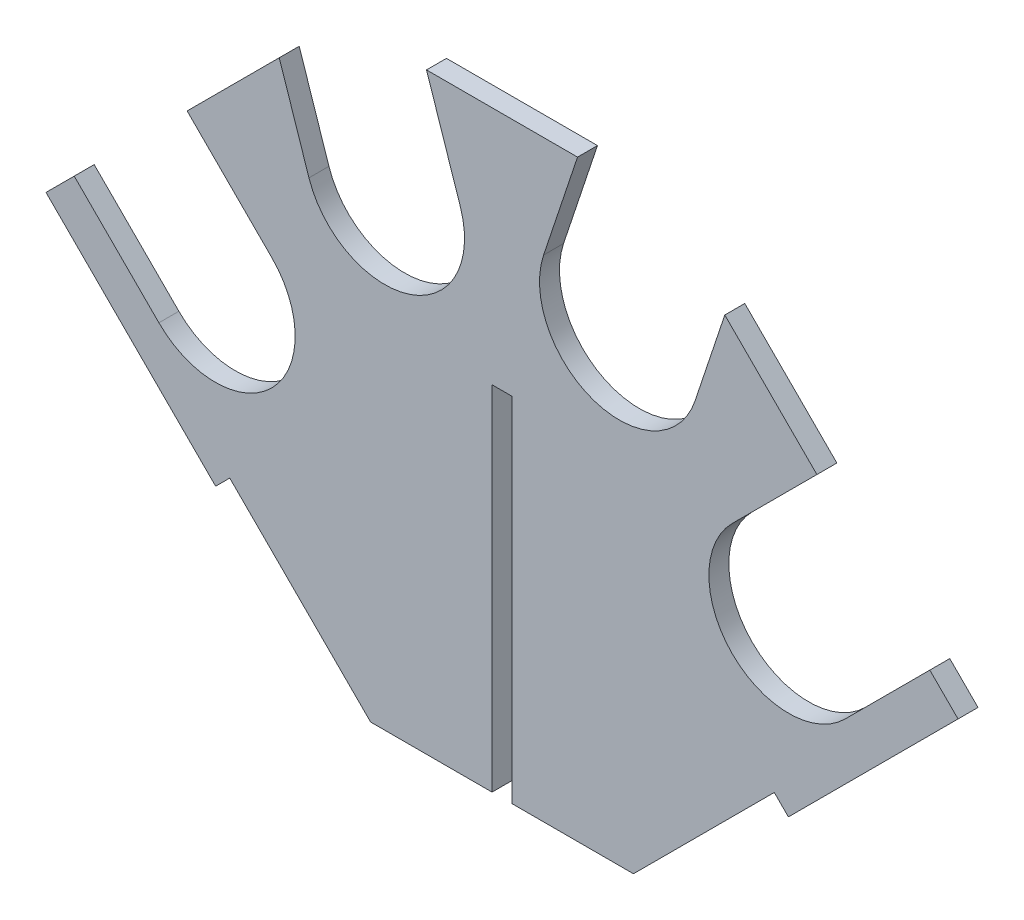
ISO-10303-21;
HEADER;
FILE_DESCRIPTION(('STEP AP214'),'2;1');
FILE_NAME('part.step','',(''),(''),'','','');
FILE_SCHEMA(('AUTOMOTIVE_DESIGN { 1 0 10303 214 1 1 1 1 }'));
ENDSEC;
DATA;
#1=APPLICATION_CONTEXT('core data for automotive mechanical design processes');
#2=APPLICATION_PROTOCOL_DEFINITION('international standard','automotive_design',2000,#1);
#3=PRODUCT_CONTEXT('',#1,'mechanical');
#4=PRODUCT('Part','Part','',(#3));
#5=PRODUCT_RELATED_PRODUCT_CATEGORY('part','',(#4));
#6=PRODUCT_DEFINITION_FORMATION('','',#4);
#7=PRODUCT_DEFINITION_CONTEXT('part definition',#1,'design');
#8=PRODUCT_DEFINITION('design','',#6,#7);
#9=PRODUCT_DEFINITION_SHAPE('','',#8);
#10=(LENGTH_UNIT() NAMED_UNIT(*) SI_UNIT(.MILLI.,.METRE.));
#11=(NAMED_UNIT(*) PLANE_ANGLE_UNIT() SI_UNIT($,.RADIAN.));
#12=(NAMED_UNIT(*) SI_UNIT($,.STERADIAN.) SOLID_ANGLE_UNIT());
#13=UNCERTAINTY_MEASURE_WITH_UNIT(LENGTH_MEASURE(1.E-05),#10,'distance_accuracy_value','');
#14=(GEOMETRIC_REPRESENTATION_CONTEXT(3) GLOBAL_UNCERTAINTY_ASSIGNED_CONTEXT((#13)) GLOBAL_UNIT_ASSIGNED_CONTEXT((#10,
#11,#12)) REPRESENTATION_CONTEXT('',''));
#15=CARTESIAN_POINT('',(0.,0.,0.));
#16=DIRECTION('',(0.,0.,1.));
#17=DIRECTION('',(1.,0.,0.));
#18=AXIS2_PLACEMENT_3D('',#15,#16,#17);
#19=CARTESIAN_POINT('',(-101.6,478.770757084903,12.7));
#20=DIRECTION('',(0.707106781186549,-0.707106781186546,0.));
#21=DIRECTION('',(0.707106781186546,0.707106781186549,0.));
#22=AXIS2_PLACEMENT_3D('',#19,#20,#21);
#23=PLANE('',#22);
#24=DIRECTION('',(-0.707106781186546,-0.707106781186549,0.));
#25=VECTOR('',#24,1.);
#26=CARTESIAN_POINT('',(-101.6,478.770757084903,0.));
#27=LINE('',#26,#25);
#28=CARTESIAN_POINT('',(-141.760926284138,438.609830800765,0.));
#29=VERTEX_POINT('',#28);
#30=CARTESIAN_POINT('',(-200.38281733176,379.987939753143,0.));
#31=VERTEX_POINT('',#30);
#32=EDGE_CURVE('E239',#29,#31,#27,.T.);
#33=ORIENTED_EDGE('',*,*,#32,.T.);
#34=DIRECTION('',(0.,0.,1.));
#35=VECTOR('',#34,1.);
#36=CARTESIAN_POINT('',(-200.38281733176,379.987939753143,-0.000999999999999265));
#37=LINE('',#36,#35);
#38=CARTESIAN_POINT('',(-200.38281733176,379.987939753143,12.7));
#39=VERTEX_POINT('',#38);
#40=EDGE_CURVE('E224',#31,#39,#37,.T.);
#41=ORIENTED_EDGE('',*,*,#40,.T.);
#42=DIRECTION('',(-0.707106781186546,-0.707106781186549,0.));
#43=VECTOR('',#42,1.);
#44=CARTESIAN_POINT('',(-101.6,478.770757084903,12.7));
#45=LINE('',#44,#43);
#46=CARTESIAN_POINT('',(-141.760926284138,438.609830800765,12.7));
#47=VERTEX_POINT('',#46);
#48=EDGE_CURVE('E336',#47,#39,#45,.T.);
#49=ORIENTED_EDGE('',*,*,#48,.F.);
#50=DIRECTION('',(0.,0.,1.));
#51=VECTOR('',#50,1.);
#52=CARTESIAN_POINT('',(-141.760926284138,438.609830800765,-0.000999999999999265));
#53=LINE('',#52,#51);
#54=EDGE_CURVE('E412',#29,#47,#53,.T.);
#55=ORIENTED_EDGE('',*,*,#54,.F.);
#56=EDGE_LOOP('',(#33,#41,#49,#55));
#57=FACE_BOUND('',#56,.T.);
#58=ADVANCED_FACE('F31',(#57),#23,.F.);
#59=CARTESIAN_POINT('',(-182.422305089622,290.185378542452,12.7));
#60=DIRECTION('',(0.,0.,-1.));
#61=DIRECTION('',(-1.,0.,0.));
#62=AXIS2_PLACEMENT_3D('',#59,#60,#61);
#63=CYLINDRICAL_SURFACE('',#62,50.8);
#64=CARTESIAN_POINT('',(-182.422305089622,290.185378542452,12.7));
#65=DIRECTION('',(0.,0.,1.));
#66=DIRECTION('',(1.,0.,0.));
#67=AXIS2_PLACEMENT_3D('',#64,#65,#66);
#68=CIRCLE('',#67,50.8);
#69=CARTESIAN_POINT('',(-218.343329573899,254.264354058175,12.7));
#70=VERTEX_POINT('',#69);
#71=CARTESIAN_POINT('',(-146.501280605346,326.106403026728,12.7));
#72=VERTEX_POINT('',#71);
#73=EDGE_CURVE('E362',#70,#72,#68,.T.);
#74=ORIENTED_EDGE('',*,*,#73,.T.);
#75=DIRECTION('',(0.,0.,1.));
#76=VECTOR('',#75,1.);
#77=CARTESIAN_POINT('',(-146.501280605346,326.106403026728,-0.000999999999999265));
#78=LINE('',#77,#76);
#79=CARTESIAN_POINT('',(-146.501280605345,326.106403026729,0.));
#80=VERTEX_POINT('',#79);
#81=EDGE_CURVE('E421',#80,#72,#78,.T.);
#82=ORIENTED_EDGE('',*,*,#81,.F.);
#83=CARTESIAN_POINT('',(-182.422305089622,290.185378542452,0.));
#84=DIRECTION('',(0.,0.,1.));
#85=DIRECTION('',(1.,0.,0.));
#86=AXIS2_PLACEMENT_3D('',#83,#84,#85);
#87=CIRCLE('',#86,50.8);
#88=CARTESIAN_POINT('',(-218.343329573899,254.264354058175,0.));
#89=VERTEX_POINT('',#88);
#90=EDGE_CURVE('E365',#89,#80,#87,.T.);
#91=ORIENTED_EDGE('',*,*,#90,.F.);
#92=DIRECTION('',(0.,0.,1.));
#93=VECTOR('',#92,1.);
#94=CARTESIAN_POINT('',(-218.343329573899,254.264354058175,-0.000999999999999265));
#95=LINE('',#94,#93);
#96=EDGE_CURVE('E218',#89,#70,#95,.T.);
#97=ORIENTED_EDGE('',*,*,#96,.T.);
#98=EDGE_LOOP('',(#74,#82,#91,#97));
#99=FACE_BOUND('',#98,.T.);
#100=ADVANCED_FACE('F449',(#99),#63,.F.);
#101=CARTESIAN_POINT('',(74.6592316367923,397.948451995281,12.7));
#102=DIRECTION('',(0.,0.,-1.));
#103=DIRECTION('',(-1.,0.,0.));
#104=AXIS2_PLACEMENT_3D('',#101,#102,#103);
#105=CYLINDRICAL_SURFACE('',#104,50.8);
#106=CARTESIAN_POINT('',(74.6592316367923,397.948451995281,12.7));
#107=DIRECTION('',(0.,0.,1.));
#108=DIRECTION('',(1.,0.,0.));
#109=AXIS2_PLACEMENT_3D('',#106,#107,#108);
#110=CIRCLE('',#109,50.8);
#111=CARTESIAN_POINT('',(26.4661200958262,414.012822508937,12.7));
#112=VERTEX_POINT('',#111);
#113=CARTESIAN_POINT('',(122.852343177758,381.884081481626,12.7));
#114=VERTEX_POINT('',#113);
#115=EDGE_CURVE('E350',#112,#114,#110,.T.);
#116=ORIENTED_EDGE('',*,*,#115,.T.);
#117=DIRECTION('',(0.,0.,1.));
#118=VECTOR('',#117,1.);
#119=CARTESIAN_POINT('',(122.852343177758,381.884081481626,-0.000999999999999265));
#120=LINE('',#119,#118);
#121=CARTESIAN_POINT('',(122.852343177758,381.884081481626,0.));
#122=VERTEX_POINT('',#121);
#123=EDGE_CURVE('E392',#122,#114,#120,.T.);
#124=ORIENTED_EDGE('',*,*,#123,.F.);
#125=CARTESIAN_POINT('',(74.6592316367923,397.948451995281,0.));
#126=DIRECTION('',(0.,0.,1.));
#127=DIRECTION('',(1.,0.,0.));
#128=AXIS2_PLACEMENT_3D('',#125,#126,#127);
#129=CIRCLE('',#128,50.8);
#130=CARTESIAN_POINT('',(26.4661200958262,414.012822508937,0.));
#131=VERTEX_POINT('',#130);
#132=EDGE_CURVE('E353',#131,#122,#129,.T.);
#133=ORIENTED_EDGE('',*,*,#132,.F.);
#134=DIRECTION('',(0.,0.,1.));
#135=VECTOR('',#134,1.);
#136=CARTESIAN_POINT('',(26.4661200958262,414.012822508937,-0.000999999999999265));
#137=LINE('',#136,#135);
#138=EDGE_CURVE('E388',#131,#112,#137,.T.);
#139=ORIENTED_EDGE('',*,*,#138,.T.);
#140=EDGE_LOOP('',(#116,#124,#133,#139));
#141=FACE_BOUND('',#140,.T.);
#142=ADVANCED_FACE('F521',(#141),#105,.F.);
#143=CARTESIAN_POINT('',(101.6,478.770757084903,12.7));
#144=DIRECTION('',(-0.707106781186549,-0.707106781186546,0.));
#145=DIRECTION('',(0.707106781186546,-0.707106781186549,0.));
#146=AXIS2_PLACEMENT_3D('',#143,#144,#145);
#147=PLANE('',#146);
#148=DIRECTION('',(-0.707106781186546,0.707106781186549,0.));
#149=VECTOR('',#148,1.);
#150=CARTESIAN_POINT('',(101.6,478.770757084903,0.));
#151=LINE('',#150,#149);
#152=CARTESIAN_POINT('',(290.185378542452,290.185378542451,0.));
#153=VERTEX_POINT('',#152);
#154=CARTESIAN_POINT('',(272.224866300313,308.145890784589,0.));
#155=VERTEX_POINT('',#154);
#156=EDGE_CURVE('E244',#153,#155,#151,.T.);
#157=ORIENTED_EDGE('',*,*,#156,.T.);
#158=DIRECTION('',(0.,0.,1.));
#159=VECTOR('',#158,1.);
#160=CARTESIAN_POINT('',(272.224866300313,308.145890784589,-0.000999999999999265));
#161=LINE('',#160,#159);
#162=CARTESIAN_POINT('',(272.224866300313,308.145890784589,12.7));
#163=VERTEX_POINT('',#162);
#164=EDGE_CURVE('E371',#155,#163,#161,.T.);
#165=ORIENTED_EDGE('',*,*,#164,.T.);
#166=DIRECTION('',(-0.707106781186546,0.707106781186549,0.));
#167=VECTOR('',#166,1.);
#168=CARTESIAN_POINT('',(101.6,478.770757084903,12.7));
#169=LINE('',#168,#167);
#170=CARTESIAN_POINT('',(290.185378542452,290.185378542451,12.7));
#171=VERTEX_POINT('',#170);
#172=EDGE_CURVE('E304',#171,#163,#169,.T.);
#173=ORIENTED_EDGE('',*,*,#172,.F.);
#174=DIRECTION('',(0.,0.,-1.));
#175=VECTOR('',#174,1.);
#176=CARTESIAN_POINT('',(290.185378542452,290.185378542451,12.7));
#177=LINE('',#176,#175);
#178=EDGE_CURVE('E39',#171,#153,#177,.T.);
#179=ORIENTED_EDGE('',*,*,#178,.T.);
#180=EDGE_LOOP('',(#157,#165,#173,#179));
#181=FACE_BOUND('',#180,.T.);
#182=ADVANCED_FACE('F301',(#181),#147,.F.);
#183=CARTESIAN_POINT('',(182.422305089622,290.185378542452,12.7));
#184=DIRECTION('',(0.,0.,-1.));
#185=DIRECTION('',(-1.,0.,0.));
#186=AXIS2_PLACEMENT_3D('',#183,#184,#185);
#187=CYLINDRICAL_SURFACE('',#186,50.8);
#188=CARTESIAN_POINT('',(182.422305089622,290.185378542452,12.7));
#189=DIRECTION('',(0.,0.,1.));
#190=DIRECTION('',(1.,0.,0.));
#191=AXIS2_PLACEMENT_3D('',#188,#189,#190);
#192=CIRCLE('',#191,50.8);
#193=CARTESIAN_POINT('',(146.501280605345,326.106403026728,12.7));
#194=VERTEX_POINT('',#193);
#195=CARTESIAN_POINT('',(218.343329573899,254.264354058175,12.7));
#196=VERTEX_POINT('',#195);
#197=EDGE_CURVE('E318',#194,#196,#192,.T.);
#198=ORIENTED_EDGE('',*,*,#197,.T.);
#199=DIRECTION('',(0.,0.,1.));
#200=VECTOR('',#199,1.);
#201=CARTESIAN_POINT('',(218.343329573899,254.264354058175,-0.000999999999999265));
#202=LINE('',#201,#200);
#203=CARTESIAN_POINT('',(218.343329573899,254.264354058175,0.));
#204=VERTEX_POINT('',#203);
#205=EDGE_CURVE('E378',#204,#196,#202,.T.);
#206=ORIENTED_EDGE('',*,*,#205,.F.);
#207=CARTESIAN_POINT('',(182.422305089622,290.185378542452,0.));
#208=DIRECTION('',(0.,0.,1.));
#209=DIRECTION('',(1.,0.,0.));
#210=AXIS2_PLACEMENT_3D('',#207,#208,#209);
#211=CIRCLE('',#210,50.8);
#212=CARTESIAN_POINT('',(146.501280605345,326.106403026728,0.));
#213=VERTEX_POINT('',#212);
#214=EDGE_CURVE('E348',#213,#204,#211,.T.);
#215=ORIENTED_EDGE('',*,*,#214,.F.);
#216=DIRECTION('',(0.,0.,1.));
#217=VECTOR('',#216,1.);
#218=CARTESIAN_POINT('',(146.501280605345,326.106403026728,-0.000999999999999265));
#219=LINE('',#218,#217);
#220=EDGE_CURVE('E374',#213,#194,#219,.T.);
#221=ORIENTED_EDGE('',*,*,#220,.T.);
#222=EDGE_LOOP('',(#198,#206,#215,#221));
#223=FACE_BOUND('',#222,.T.);
#224=ADVANCED_FACE('F503',(#223),#187,.F.);
#225=CARTESIAN_POINT('',(1.38777878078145E-13,364.470757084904,12.7));
#226=DIRECTION('',(0.,0.,1.));
#227=DIRECTION('',(1.,0.,0.));
#228=AXIS2_PLACEMENT_3D('',#225,#226,#227);
#229=PLANE('',#228);
#230=DIRECTION('',(-0.707106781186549,0.707106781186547,0.));
#231=VECTOR('',#230,1.);
#232=CARTESIAN_POINT('',(-200.38281733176,379.987939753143,12.7));
#233=LINE('',#232,#231);
#234=EDGE_CURVE('E233',#72,#39,#233,.T.);
#235=ORIENTED_EDGE('',*,*,#234,.F.);
#236=ORIENTED_EDGE('',*,*,#73,.F.);
#237=DIRECTION('',(0.707106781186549,-0.707106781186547,0.));
#238=VECTOR('',#237,1.);
#239=CARTESIAN_POINT('',(-272.224866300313,308.14589078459,12.7));
#240=LINE('',#239,#238);
#241=CARTESIAN_POINT('',(-272.224866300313,308.14589078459,12.7));
#242=VERTEX_POINT('',#241);
#243=EDGE_CURVE('E54',#242,#70,#240,.T.);
#244=ORIENTED_EDGE('',*,*,#243,.F.);
#245=CARTESIAN_POINT('',(-290.185378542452,290.185378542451,12.7));
#246=VERTEX_POINT('',#245);
#247=EDGE_CURVE('E232',#242,#246,#45,.T.);
#248=ORIENTED_EDGE('',*,*,#247,.T.);
#249=DIRECTION('',(0.707106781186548,-0.707106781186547,0.));
#250=VECTOR('',#249,1.);
#251=CARTESIAN_POINT('',(-182.235378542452,182.235378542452,12.7));
#252=LINE('',#251,#250);
#253=CARTESIAN_POINT('',(-182.235378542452,182.235378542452,12.7));
#254=VERTEX_POINT('',#253);
#255=EDGE_CURVE('E334',#246,#254,#252,.T.);
#256=ORIENTED_EDGE('',*,*,#255,.T.);
#257=DIRECTION('',(0.707106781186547,0.707106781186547,0.));
#258=VECTOR('',#257,1.);
#259=CARTESIAN_POINT('',(-182.235378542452,182.235378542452,12.7));
#260=LINE('',#259,#258);
#261=CARTESIAN_POINT('',(-173.255122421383,191.215634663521,12.7));
#262=VERTEX_POINT('',#261);
#263=EDGE_CURVE('E332',#254,#262,#260,.T.);
#264=ORIENTED_EDGE('',*,*,#263,.T.);
#265=DIRECTION('',(0.707106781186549,-0.707106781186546,0.));
#266=VECTOR('',#265,1.);
#267=CARTESIAN_POINT('',(-173.255122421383,191.215634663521,12.7));
#268=LINE('',#267,#266);
#269=CARTESIAN_POINT('',(-83.6394877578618,101.6,12.7));
#270=VERTEX_POINT('',#269);
#271=EDGE_CURVE('E330',#262,#270,#268,.T.);
#272=ORIENTED_EDGE('',*,*,#271,.T.);
#273=DIRECTION('',(1.,0.,0.));
#274=VECTOR('',#273,1.);
#275=CARTESIAN_POINT('',(-83.6394877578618,101.6,12.7));
#276=LINE('',#275,#274);
#277=CARTESIAN_POINT('',(-6.35,101.6,12.7));
#278=VERTEX_POINT('',#277);
#279=EDGE_CURVE('E328',#270,#278,#276,.T.);
#280=ORIENTED_EDGE('',*,*,#279,.T.);
#281=DIRECTION('',(0.,1.,0.));
#282=VECTOR('',#281,1.);
#283=CARTESIAN_POINT('',(-6.35,326.106403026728,12.7));
#284=LINE('',#283,#282);
#285=CARTESIAN_POINT('',(-6.35,326.106403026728,12.7));
#286=VERTEX_POINT('',#285);
#287=EDGE_CURVE('E326',#278,#286,#284,.T.);
#288=ORIENTED_EDGE('',*,*,#287,.T.);
#289=DIRECTION('',(1.,0.,0.));
#290=VECTOR('',#289,1.);
#291=CARTESIAN_POINT('',(-6.35,326.106403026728,12.7));
#292=LINE('',#291,#290);
#293=CARTESIAN_POINT('',(6.35,326.106403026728,12.7));
#294=VERTEX_POINT('',#293);
#295=EDGE_CURVE('E324',#286,#294,#292,.T.);
#296=ORIENTED_EDGE('',*,*,#295,.T.);
#297=DIRECTION('',(0.,-1.,0.));
#298=VECTOR('',#297,1.);
#299=CARTESIAN_POINT('',(6.35,326.106403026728,12.7));
#300=LINE('',#299,#298);
#301=CARTESIAN_POINT('',(6.35,101.6,12.7));
#302=VERTEX_POINT('',#301);
#303=EDGE_CURVE('E322',#294,#302,#300,.T.);
#304=ORIENTED_EDGE('',*,*,#303,.T.);
#305=DIRECTION('',(1.,0.,0.));
#306=VECTOR('',#305,1.);
#307=CARTESIAN_POINT('',(6.35,101.6,12.7));
#308=LINE('',#307,#306);
#309=CARTESIAN_POINT('',(83.6394877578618,101.6,12.7));
#310=VERTEX_POINT('',#309);
#311=EDGE_CURVE('E320',#302,#310,#308,.T.);
#312=ORIENTED_EDGE('',*,*,#311,.T.);
#313=DIRECTION('',(0.70710678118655,0.707106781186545,0.));
#314=VECTOR('',#313,1.);
#315=CARTESIAN_POINT('',(173.255122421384,191.215634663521,12.7));
#316=LINE('',#315,#314);
#317=CARTESIAN_POINT('',(173.255122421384,191.215634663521,12.7));
#318=VERTEX_POINT('',#317);
#319=EDGE_CURVE('E270',#310,#318,#316,.T.);
#320=ORIENTED_EDGE('',*,*,#319,.T.);
#321=DIRECTION('',(0.707106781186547,-0.707106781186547,0.));
#322=VECTOR('',#321,1.);
#323=CARTESIAN_POINT('',(173.255122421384,191.215634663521,12.7));
#324=LINE('',#323,#322);
#325=CARTESIAN_POINT('',(182.235378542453,182.235378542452,12.7));
#326=VERTEX_POINT('',#325);
#327=EDGE_CURVE('E265',#318,#326,#324,.T.);
#328=ORIENTED_EDGE('',*,*,#327,.T.);
#329=DIRECTION('',(0.707106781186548,0.707106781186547,0.));
#330=VECTOR('',#329,1.);
#331=CARTESIAN_POINT('',(182.235378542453,182.235378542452,12.7));
#332=LINE('',#331,#330);
#333=EDGE_CURVE('E344',#326,#171,#332,.T.);
#334=ORIENTED_EDGE('',*,*,#333,.T.);
#335=ORIENTED_EDGE('',*,*,#172,.T.);
#336=DIRECTION('',(0.707106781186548,0.707106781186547,0.));
#337=VECTOR('',#336,1.);
#338=CARTESIAN_POINT('',(272.224866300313,308.145890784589,12.7));
#339=LINE('',#338,#337);
#340=EDGE_CURVE('E375',#196,#163,#339,.T.);
#341=ORIENTED_EDGE('',*,*,#340,.F.);
#342=ORIENTED_EDGE('',*,*,#197,.F.);
#343=DIRECTION('',(-0.707106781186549,-0.707106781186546,0.));
#344=VECTOR('',#343,1.);
#345=CARTESIAN_POINT('',(200.38281733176,379.987939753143,12.7));
#346=LINE('',#345,#344);
#347=CARTESIAN_POINT('',(200.38281733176,379.987939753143,12.7));
#348=VERTEX_POINT('',#347);
#349=EDGE_CURVE('E382',#348,#194,#346,.T.);
#350=ORIENTED_EDGE('',*,*,#349,.F.);
#351=CARTESIAN_POINT('',(141.760926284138,438.609830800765,12.7));
#352=VERTEX_POINT('',#351);
#353=EDGE_CURVE('E343',#348,#352,#169,.T.);
#354=ORIENTED_EDGE('',*,*,#353,.T.);
#355=DIRECTION('',(0.316227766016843,0.948683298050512,0.));
#356=VECTOR('',#355,1.);
#357=CARTESIAN_POINT('',(141.760926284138,438.609830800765,12.7));
#358=LINE('',#357,#356);
#359=EDGE_CURVE('E389',#114,#352,#358,.T.);
#360=ORIENTED_EDGE('',*,*,#359,.F.);
#361=ORIENTED_EDGE('',*,*,#115,.F.);
#362=DIRECTION('',(-0.316227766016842,-0.948683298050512,0.));
#363=VECTOR('',#362,1.);
#364=CARTESIAN_POINT('',(48.0520982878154,478.770757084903,12.7));
#365=LINE('',#364,#363);
#366=CARTESIAN_POINT('',(48.0520982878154,478.770757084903,12.7));
#367=VERTEX_POINT('',#366);
#368=EDGE_CURVE('E397',#367,#112,#365,.T.);
#369=ORIENTED_EDGE('',*,*,#368,.F.);
#370=DIRECTION('',(-1.,0.,0.));
#371=VECTOR('',#370,1.);
#372=CARTESIAN_POINT('',(-101.6,478.770757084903,12.7));
#373=LINE('',#372,#371);
#374=CARTESIAN_POINT('',(-48.0520982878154,478.770757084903,12.7));
#375=VERTEX_POINT('',#374);
#376=EDGE_CURVE('E339',#367,#375,#373,.T.);
#377=ORIENTED_EDGE('',*,*,#376,.T.);
#378=DIRECTION('',(-0.316227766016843,0.948683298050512,0.));
#379=VECTOR('',#378,1.);
#380=CARTESIAN_POINT('',(-48.0520982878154,478.770757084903,12.7));
#381=LINE('',#380,#379);
#382=CARTESIAN_POINT('',(-26.4661200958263,414.012822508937,12.7));
#383=VERTEX_POINT('',#382);
#384=EDGE_CURVE('E417',#383,#375,#381,.T.);
#385=ORIENTED_EDGE('',*,*,#384,.F.);
#386=CARTESIAN_POINT('',(-74.6592316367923,397.948451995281,12.7));
#387=DIRECTION('',(0.,0.,1.));
#388=DIRECTION('',(1.,0.,0.));
#389=AXIS2_PLACEMENT_3D('',#386,#387,#388);
#390=CIRCLE('',#389,50.8);
#391=CARTESIAN_POINT('',(-122.852343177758,381.884081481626,12.7));
#392=VERTEX_POINT('',#391);
#393=EDGE_CURVE('E356',#392,#383,#390,.T.);
#394=ORIENTED_EDGE('',*,*,#393,.F.);
#395=DIRECTION('',(0.316227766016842,-0.948683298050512,0.));
#396=VECTOR('',#395,1.);
#397=CARTESIAN_POINT('',(-141.760926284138,438.609830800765,12.7));
#398=LINE('',#397,#396);
#399=EDGE_CURVE('E409',#47,#392,#398,.T.);
#400=ORIENTED_EDGE('',*,*,#399,.F.);
#401=ORIENTED_EDGE('',*,*,#48,.T.);
#402=EDGE_LOOP('',(#235,#236,#244,#248,#256,#264,#272,#280,#288,#296,#304,#312,#320,#328,#334,
#335,#341,#342,#350,#354,#360,#361,#369,#377,#385,#394,#400,#401));
#403=FACE_BOUND('',#402,.T.);
#404=ADVANCED_FACE('F436',(#403),#229,.T.);
#405=CARTESIAN_POINT('',(1.38777878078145E-13,364.470757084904,0.));
#406=DIRECTION('',(0.,0.,1.));
#407=DIRECTION('',(1.,0.,0.));
#408=AXIS2_PLACEMENT_3D('',#405,#406,#407);
#409=PLANE('',#408);
#410=ORIENTED_EDGE('',*,*,#90,.T.);
#411=DIRECTION('',(0.707106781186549,-0.707106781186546,0.));
#412=VECTOR('',#411,1.);
#413=CARTESIAN_POINT('',(-200.38281733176,379.987939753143,0.));
#414=LINE('',#413,#412);
#415=EDGE_CURVE('E46',#31,#80,#414,.T.);
#416=ORIENTED_EDGE('',*,*,#415,.F.);
#417=ORIENTED_EDGE('',*,*,#32,.F.);
#418=DIRECTION('',(-0.316227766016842,0.948683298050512,0.));
#419=VECTOR('',#418,1.);
#420=CARTESIAN_POINT('',(-141.760926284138,438.609830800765,0.));
#421=LINE('',#420,#419);
#422=CARTESIAN_POINT('',(-122.852343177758,381.884081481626,0.));
#423=VERTEX_POINT('',#422);
#424=EDGE_CURVE('E223',#423,#29,#421,.T.);
#425=ORIENTED_EDGE('',*,*,#424,.F.);
#426=CARTESIAN_POINT('',(-74.6592316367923,397.948451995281,0.));
#427=DIRECTION('',(0.,0.,1.));
#428=DIRECTION('',(1.,0.,0.));
#429=AXIS2_PLACEMENT_3D('',#426,#427,#428);
#430=CIRCLE('',#429,50.8);
#431=CARTESIAN_POINT('',(-26.4661200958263,414.012822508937,0.));
#432=VERTEX_POINT('',#431);
#433=EDGE_CURVE('E359',#423,#432,#430,.T.);
#434=ORIENTED_EDGE('',*,*,#433,.T.);
#435=DIRECTION('',(0.316227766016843,-0.948683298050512,0.));
#436=VECTOR('',#435,1.);
#437=CARTESIAN_POINT('',(-48.0520982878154,478.770757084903,0.));
#438=LINE('',#437,#436);
#439=CARTESIAN_POINT('',(-48.0520982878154,478.770757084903,0.));
#440=VERTEX_POINT('',#439);
#441=EDGE_CURVE('E403',#440,#432,#438,.T.);
#442=ORIENTED_EDGE('',*,*,#441,.F.);
#443=DIRECTION('',(-1.,0.,0.));
#444=VECTOR('',#443,1.);
#445=CARTESIAN_POINT('',(-101.6,478.770757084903,0.));
#446=LINE('',#445,#444);
#447=CARTESIAN_POINT('',(48.0520982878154,478.770757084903,0.));
#448=VERTEX_POINT('',#447);
#449=EDGE_CURVE('E240',#448,#440,#446,.T.);
#450=ORIENTED_EDGE('',*,*,#449,.F.);
#451=DIRECTION('',(0.316227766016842,0.948683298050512,0.));
#452=VECTOR('',#451,1.);
#453=CARTESIAN_POINT('',(48.0520982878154,478.770757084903,0.));
#454=LINE('',#453,#452);
#455=EDGE_CURVE('E401',#131,#448,#454,.T.);
#456=ORIENTED_EDGE('',*,*,#455,.F.);
#457=ORIENTED_EDGE('',*,*,#132,.T.);
#458=DIRECTION('',(-0.316227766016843,-0.948683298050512,0.));
#459=VECTOR('',#458,1.);
#460=CARTESIAN_POINT('',(141.760926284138,438.609830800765,0.));
#461=LINE('',#460,#459);
#462=CARTESIAN_POINT('',(141.760926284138,438.609830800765,0.));
#463=VERTEX_POINT('',#462);
#464=EDGE_CURVE('E399',#463,#122,#461,.T.);
#465=ORIENTED_EDGE('',*,*,#464,.F.);
#466=CARTESIAN_POINT('',(200.38281733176,379.987939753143,0.));
#467=VERTEX_POINT('',#466);
#468=EDGE_CURVE('E311',#467,#463,#151,.T.);
#469=ORIENTED_EDGE('',*,*,#468,.F.);
#470=DIRECTION('',(0.707106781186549,0.707106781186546,0.));
#471=VECTOR('',#470,1.);
#472=CARTESIAN_POINT('',(200.38281733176,379.987939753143,0.));
#473=LINE('',#472,#471);
#474=EDGE_CURVE('E367',#213,#467,#473,.T.);
#475=ORIENTED_EDGE('',*,*,#474,.F.);
#476=ORIENTED_EDGE('',*,*,#214,.T.);
#477=DIRECTION('',(-0.707106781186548,-0.707106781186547,0.));
#478=VECTOR('',#477,1.);
#479=CARTESIAN_POINT('',(272.224866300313,308.145890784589,0.));
#480=LINE('',#479,#478);
#481=EDGE_CURVE('E310',#155,#204,#480,.T.);
#482=ORIENTED_EDGE('',*,*,#481,.F.);
#483=ORIENTED_EDGE('',*,*,#156,.F.);
#484=DIRECTION('',(0.707106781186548,0.707106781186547,0.));
#485=VECTOR('',#484,1.);
#486=CARTESIAN_POINT('',(182.235378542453,182.235378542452,0.));
#487=LINE('',#486,#485);
#488=CARTESIAN_POINT('',(182.235378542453,182.235378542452,0.));
#489=VERTEX_POINT('',#488);
#490=EDGE_CURVE('E308',#489,#153,#487,.T.);
#491=ORIENTED_EDGE('',*,*,#490,.F.);
#492=DIRECTION('',(0.707106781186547,-0.707106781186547,0.));
#493=VECTOR('',#492,1.);
#494=CARTESIAN_POINT('',(173.255122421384,191.215634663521,0.));
#495=LINE('',#494,#493);
#496=CARTESIAN_POINT('',(173.255122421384,191.215634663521,0.));
#497=VERTEX_POINT('',#496);
#498=EDGE_CURVE('E315',#497,#489,#495,.T.);
#499=ORIENTED_EDGE('',*,*,#498,.F.);
#500=DIRECTION('',(0.70710678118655,0.707106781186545,0.));
#501=VECTOR('',#500,1.);
#502=CARTESIAN_POINT('',(173.255122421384,191.215634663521,0.));
#503=LINE('',#502,#501);
#504=CARTESIAN_POINT('',(83.6394877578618,101.6,0.));
#505=VERTEX_POINT('',#504);
#506=EDGE_CURVE('E263',#505,#497,#503,.T.);
#507=ORIENTED_EDGE('',*,*,#506,.F.);
#508=DIRECTION('',(1.,0.,0.));
#509=VECTOR('',#508,1.);
#510=CARTESIAN_POINT('',(6.35,101.6,0.));
#511=LINE('',#510,#509);
#512=CARTESIAN_POINT('',(6.35,101.6,0.));
#513=VERTEX_POINT('',#512);
#514=EDGE_CURVE('E261',#513,#505,#511,.T.);
#515=ORIENTED_EDGE('',*,*,#514,.F.);
#516=DIRECTION('',(0.,-1.,0.));
#517=VECTOR('',#516,1.);
#518=CARTESIAN_POINT('',(6.35,326.106403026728,0.));
#519=LINE('',#518,#517);
#520=CARTESIAN_POINT('',(6.35,326.106403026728,0.));
#521=VERTEX_POINT('',#520);
#522=EDGE_CURVE('E259',#521,#513,#519,.T.);
#523=ORIENTED_EDGE('',*,*,#522,.F.);
#524=DIRECTION('',(1.,0.,0.));
#525=VECTOR('',#524,1.);
#526=CARTESIAN_POINT('',(-6.35,326.106403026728,0.));
#527=LINE('',#526,#525);
#528=CARTESIAN_POINT('',(-6.35,326.106403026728,0.));
#529=VERTEX_POINT('',#528);
#530=EDGE_CURVE('E257',#529,#521,#527,.T.);
#531=ORIENTED_EDGE('',*,*,#530,.F.);
#532=DIRECTION('',(0.,1.,0.));
#533=VECTOR('',#532,1.);
#534=CARTESIAN_POINT('',(-6.35,326.106403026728,0.));
#535=LINE('',#534,#533);
#536=CARTESIAN_POINT('',(-6.35,101.6,0.));
#537=VERTEX_POINT('',#536);
#538=EDGE_CURVE('E255',#537,#529,#535,.T.);
#539=ORIENTED_EDGE('',*,*,#538,.F.);
#540=DIRECTION('',(1.,0.,0.));
#541=VECTOR('',#540,1.);
#542=CARTESIAN_POINT('',(-83.6394877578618,101.6,0.));
#543=LINE('',#542,#541);
#544=CARTESIAN_POINT('',(-83.6394877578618,101.6,0.));
#545=VERTEX_POINT('',#544);
#546=EDGE_CURVE('E253',#545,#537,#543,.T.);
#547=ORIENTED_EDGE('',*,*,#546,.F.);
#548=DIRECTION('',(0.707106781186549,-0.707106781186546,0.));
#549=VECTOR('',#548,1.);
#550=CARTESIAN_POINT('',(-173.255122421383,191.215634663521,0.));
#551=LINE('',#550,#549);
#552=CARTESIAN_POINT('',(-173.255122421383,191.215634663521,0.));
#553=VERTEX_POINT('',#552);
#554=EDGE_CURVE('E251',#553,#545,#551,.T.);
#555=ORIENTED_EDGE('',*,*,#554,.F.);
#556=DIRECTION('',(0.707106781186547,0.707106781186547,0.));
#557=VECTOR('',#556,1.);
#558=CARTESIAN_POINT('',(-182.235378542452,182.235378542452,0.));
#559=LINE('',#558,#557);
#560=CARTESIAN_POINT('',(-182.235378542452,182.235378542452,0.));
#561=VERTEX_POINT('',#560);
#562=EDGE_CURVE('E249',#561,#553,#559,.T.);
#563=ORIENTED_EDGE('',*,*,#562,.F.);
#564=DIRECTION('',(0.707106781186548,-0.707106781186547,0.));
#565=VECTOR('',#564,1.);
#566=CARTESIAN_POINT('',(-182.235378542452,182.235378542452,0.));
#567=LINE('',#566,#565);
#568=CARTESIAN_POINT('',(-290.185378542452,290.185378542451,0.));
#569=VERTEX_POINT('',#568);
#570=EDGE_CURVE('E238',#569,#561,#567,.T.);
#571=ORIENTED_EDGE('',*,*,#570,.F.);
#572=CARTESIAN_POINT('',(-272.224866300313,308.14589078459,0.));
#573=VERTEX_POINT('',#572);
#574=EDGE_CURVE('E230',#573,#569,#27,.T.);
#575=ORIENTED_EDGE('',*,*,#574,.F.);
#576=DIRECTION('',(-0.707106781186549,0.707106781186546,0.));
#577=VECTOR('',#576,1.);
#578=CARTESIAN_POINT('',(-272.224866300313,308.14589078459,0.));
#579=LINE('',#578,#577);
#580=EDGE_CURVE('E214',#89,#573,#579,.T.);
#581=ORIENTED_EDGE('',*,*,#580,.F.);
#582=EDGE_LOOP('',(#410,#416,#417,#425,#434,#442,#450,#456,#457,#465,#469,#475,#476,#482,#483,
#491,#499,#507,#515,#523,#531,#539,#547,#555,#563,#571,#575,#581));
#583=FACE_BOUND('',#582,.T.);
#584=ADVANCED_FACE('F236',(#583),#409,.F.);
#585=CARTESIAN_POINT('',(173.255122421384,191.215634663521,12.7));
#586=DIRECTION('',(0.707106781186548,0.707106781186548,0.));
#587=DIRECTION('',(-0.707106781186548,0.707106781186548,0.));
#588=AXIS2_PLACEMENT_3D('',#585,#586,#587);
#589=PLANE('',#588);
#590=ORIENTED_EDGE('',*,*,#498,.T.);
#591=DIRECTION('',(0.,0.,-1.));
#592=VECTOR('',#591,1.);
#593=CARTESIAN_POINT('',(182.235378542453,182.235378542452,12.7));
#594=LINE('',#593,#592);
#595=EDGE_CURVE('E11',#326,#489,#594,.T.);
#596=ORIENTED_EDGE('',*,*,#595,.F.);
#597=ORIENTED_EDGE('',*,*,#327,.F.);
#598=DIRECTION('',(0.,0.,-1.));
#599=VECTOR('',#598,1.);
#600=CARTESIAN_POINT('',(173.255122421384,191.215634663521,12.7));
#601=LINE('',#600,#599);
#602=EDGE_CURVE('E266',#318,#497,#601,.T.);
#603=ORIENTED_EDGE('',*,*,#602,.T.);
#604=EDGE_LOOP('',(#590,#596,#597,#603));
#605=FACE_BOUND('',#604,.T.);
#606=ADVANCED_FACE('F33',(#605),#589,.F.);
#607=CARTESIAN_POINT('',(182.235378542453,182.235378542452,12.7));
#608=DIRECTION('',(-0.707106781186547,0.707106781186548,0.));
#609=DIRECTION('',(-0.707106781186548,-0.707106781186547,0.));
#610=AXIS2_PLACEMENT_3D('',#607,#608,#609);
#611=PLANE('',#610);
#612=ORIENTED_EDGE('',*,*,#490,.T.);
#613=ORIENTED_EDGE('',*,*,#178,.F.);
#614=ORIENTED_EDGE('',*,*,#333,.F.);
#615=ORIENTED_EDGE('',*,*,#595,.T.);
#616=EDGE_LOOP('',(#612,#613,#614,#615));
#617=FACE_BOUND('',#616,.T.);
#618=ADVANCED_FACE('F496',(#617),#611,.F.);
#619=ORIENTED_EDGE('',*,*,#468,.T.);
#620=DIRECTION('',(0.,0.,1.));
#621=VECTOR('',#620,1.);
#622=CARTESIAN_POINT('',(141.760926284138,438.609830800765,-0.000999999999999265));
#623=LINE('',#622,#621);
#624=EDGE_CURVE('E385',#463,#352,#623,.T.);
#625=ORIENTED_EDGE('',*,*,#624,.T.);
#626=ORIENTED_EDGE('',*,*,#353,.F.);
#627=DIRECTION('',(0.,0.,1.));
#628=VECTOR('',#627,1.);
#629=CARTESIAN_POINT('',(200.38281733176,379.987939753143,-0.000999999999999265));
#630=LINE('',#629,#628);
#631=EDGE_CURVE('E372',#467,#348,#630,.T.);
#632=ORIENTED_EDGE('',*,*,#631,.F.);
#633=EDGE_LOOP('',(#619,#625,#626,#632));
#634=FACE_BOUND('',#633,.T.);
#635=ADVANCED_FACE('F512',(#634),#147,.F.);
#636=CARTESIAN_POINT('',(-101.6,478.770757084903,12.7));
#637=DIRECTION('',(0.,-1.,0.));
#638=DIRECTION('',(1.,0.,0.));
#639=AXIS2_PLACEMENT_3D('',#636,#637,#638);
#640=PLANE('',#639);
#641=ORIENTED_EDGE('',*,*,#449,.T.);
#642=DIRECTION('',(0.,0.,1.));
#643=VECTOR('',#642,1.);
#644=CARTESIAN_POINT('',(-48.0520982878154,478.770757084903,-0.000999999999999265));
#645=LINE('',#644,#643);
#646=EDGE_CURVE('E408',#440,#375,#645,.T.);
#647=ORIENTED_EDGE('',*,*,#646,.T.);
#648=ORIENTED_EDGE('',*,*,#376,.F.);
#649=DIRECTION('',(0.,0.,1.));
#650=VECTOR('',#649,1.);
#651=CARTESIAN_POINT('',(48.0520982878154,478.770757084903,-0.000999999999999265));
#652=LINE('',#651,#650);
#653=EDGE_CURVE('E386',#448,#367,#652,.T.);
#654=ORIENTED_EDGE('',*,*,#653,.F.);
#655=EDGE_LOOP('',(#641,#647,#648,#654));
#656=FACE_BOUND('',#655,.T.);
#657=ADVANCED_FACE('F528',(#656),#640,.F.);
#658=ORIENTED_EDGE('',*,*,#247,.F.);
#659=DIRECTION('',(0.,0.,1.));
#660=VECTOR('',#659,1.);
#661=CARTESIAN_POINT('',(-272.224866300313,308.14589078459,-0.000999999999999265));
#662=LINE('',#661,#660);
#663=EDGE_CURVE('E217',#573,#242,#662,.T.);
#664=ORIENTED_EDGE('',*,*,#663,.F.);
#665=ORIENTED_EDGE('',*,*,#574,.T.);
#666=DIRECTION('',(0.,0.,-1.));
#667=VECTOR('',#666,1.);
#668=CARTESIAN_POINT('',(-290.185378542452,290.185378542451,12.7));
#669=LINE('',#668,#667);
#670=EDGE_CURVE('E294',#246,#569,#669,.T.);
#671=ORIENTED_EDGE('',*,*,#670,.F.);
#672=EDGE_LOOP('',(#658,#664,#665,#671));
#673=FACE_BOUND('',#672,.T.);
#674=ADVANCED_FACE('F228',(#673),#23,.F.);
#675=CARTESIAN_POINT('',(-182.235378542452,182.235378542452,12.7));
#676=DIRECTION('',(0.707106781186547,0.707106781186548,0.));
#677=DIRECTION('',(-0.707106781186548,0.707106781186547,0.));
#678=AXIS2_PLACEMENT_3D('',#675,#676,#677);
#679=PLANE('',#678);
#680=ORIENTED_EDGE('',*,*,#570,.T.);
#681=DIRECTION('',(0.,0.,-1.));
#682=VECTOR('',#681,1.);
#683=CARTESIAN_POINT('',(-182.235378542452,182.235378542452,12.7));
#684=LINE('',#683,#682);
#685=EDGE_CURVE('E291',#254,#561,#684,.T.);
#686=ORIENTED_EDGE('',*,*,#685,.F.);
#687=ORIENTED_EDGE('',*,*,#255,.F.);
#688=ORIENTED_EDGE('',*,*,#670,.T.);
#689=EDGE_LOOP('',(#680,#686,#687,#688));
#690=FACE_BOUND('',#689,.T.);
#691=ADVANCED_FACE('F453',(#690),#679,.F.);
#692=CARTESIAN_POINT('',(-182.235378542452,182.235378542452,12.7));
#693=DIRECTION('',(-0.707106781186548,0.707106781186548,0.));
#694=DIRECTION('',(-0.707106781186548,-0.707106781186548,0.));
#695=AXIS2_PLACEMENT_3D('',#692,#693,#694);
#696=PLANE('',#695);
#697=ORIENTED_EDGE('',*,*,#562,.T.);
#698=DIRECTION('',(0.,0.,-1.));
#699=VECTOR('',#698,1.);
#700=CARTESIAN_POINT('',(-173.255122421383,191.215634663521,12.7));
#701=LINE('',#700,#699);
#702=EDGE_CURVE('E288',#262,#553,#701,.T.);
#703=ORIENTED_EDGE('',*,*,#702,.F.);
#704=ORIENTED_EDGE('',*,*,#263,.F.);
#705=ORIENTED_EDGE('',*,*,#685,.T.);
#706=EDGE_LOOP('',(#697,#703,#704,#705));
#707=FACE_BOUND('',#706,.T.);
#708=ADVANCED_FACE('F457',(#707),#696,.F.);
#709=CARTESIAN_POINT('',(-173.255122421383,191.215634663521,12.7));
#710=DIRECTION('',(0.707106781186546,0.707106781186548,0.));
#711=DIRECTION('',(-0.707106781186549,0.707106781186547,0.));
#712=AXIS2_PLACEMENT_3D('',#709,#710,#711);
#713=PLANE('',#712);
#714=ORIENTED_EDGE('',*,*,#554,.T.);
#715=DIRECTION('',(0.,0.,-1.));
#716=VECTOR('',#715,1.);
#717=CARTESIAN_POINT('',(-83.6394877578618,101.6,12.7));
#718=LINE('',#717,#716);
#719=EDGE_CURVE('E285',#270,#545,#718,.T.);
#720=ORIENTED_EDGE('',*,*,#719,.F.);
#721=ORIENTED_EDGE('',*,*,#271,.F.);
#722=ORIENTED_EDGE('',*,*,#702,.T.);
#723=EDGE_LOOP('',(#714,#720,#721,#722));
#724=FACE_BOUND('',#723,.T.);
#725=ADVANCED_FACE('F463',(#724),#713,.F.);
#726=CARTESIAN_POINT('',(-83.6394877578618,101.6,12.7));
#727=DIRECTION('',(0.,1.,0.));
#728=DIRECTION('',(-1.,0.,0.));
#729=AXIS2_PLACEMENT_3D('',#726,#727,#728);
#730=PLANE('',#729);
#731=ORIENTED_EDGE('',*,*,#546,.T.);
#732=DIRECTION('',(0.,0.,-1.));
#733=VECTOR('',#732,1.);
#734=CARTESIAN_POINT('',(-6.35,101.6,12.7));
#735=LINE('',#734,#733);
#736=EDGE_CURVE('E282',#278,#537,#735,.T.);
#737=ORIENTED_EDGE('',*,*,#736,.F.);
#738=ORIENTED_EDGE('',*,*,#279,.F.);
#739=ORIENTED_EDGE('',*,*,#719,.T.);
#740=EDGE_LOOP('',(#731,#737,#738,#739));
#741=FACE_BOUND('',#740,.T.);
#742=ADVANCED_FACE('F467',(#741),#730,.F.);
#743=CARTESIAN_POINT('',(-6.35,326.106403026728,12.7));
#744=DIRECTION('',(-1.,0.,0.));
#745=DIRECTION('',(0.,0.,1.));
#746=AXIS2_PLACEMENT_3D('',#743,#744,#745);
#747=PLANE('',#746);
#748=ORIENTED_EDGE('',*,*,#538,.T.);
#749=DIRECTION('',(0.,0.,-1.));
#750=VECTOR('',#749,1.);
#751=CARTESIAN_POINT('',(-6.35,326.106403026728,12.7));
#752=LINE('',#751,#750);
#753=EDGE_CURVE('E279',#286,#529,#752,.T.);
#754=ORIENTED_EDGE('',*,*,#753,.F.);
#755=ORIENTED_EDGE('',*,*,#287,.F.);
#756=ORIENTED_EDGE('',*,*,#736,.T.);
#757=EDGE_LOOP('',(#748,#754,#755,#756));
#758=FACE_BOUND('',#757,.T.);
#759=ADVANCED_FACE('F472',(#758),#747,.F.);
#760=CARTESIAN_POINT('',(-6.35,326.106403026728,12.7));
#761=DIRECTION('',(0.,1.,0.));
#762=DIRECTION('',(0.,0.,1.));
#763=AXIS2_PLACEMENT_3D('',#760,#761,#762);
#764=PLANE('',#763);
#765=ORIENTED_EDGE('',*,*,#530,.T.);
#766=DIRECTION('',(0.,0.,-1.));
#767=VECTOR('',#766,1.);
#768=CARTESIAN_POINT('',(6.35,326.106403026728,12.7));
#769=LINE('',#768,#767);
#770=EDGE_CURVE('E276',#294,#521,#769,.T.);
#771=ORIENTED_EDGE('',*,*,#770,.F.);
#772=ORIENTED_EDGE('',*,*,#295,.F.);
#773=ORIENTED_EDGE('',*,*,#753,.T.);
#774=EDGE_LOOP('',(#765,#771,#772,#773));
#775=FACE_BOUND('',#774,.T.);
#776=ADVANCED_FACE('F478',(#775),#764,.F.);
#777=CARTESIAN_POINT('',(6.35,326.106403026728,12.7));
#778=DIRECTION('',(1.,0.,0.));
#779=DIRECTION('',(0.,0.,-1.));
#780=AXIS2_PLACEMENT_3D('',#777,#778,#779);
#781=PLANE('',#780);
#782=ORIENTED_EDGE('',*,*,#522,.T.);
#783=DIRECTION('',(0.,0.,-1.));
#784=VECTOR('',#783,1.);
#785=CARTESIAN_POINT('',(6.35,101.6,12.7));
#786=LINE('',#785,#784);
#787=EDGE_CURVE('E273',#302,#513,#786,.T.);
#788=ORIENTED_EDGE('',*,*,#787,.F.);
#789=ORIENTED_EDGE('',*,*,#303,.F.);
#790=ORIENTED_EDGE('',*,*,#770,.T.);
#791=EDGE_LOOP('',(#782,#788,#789,#790));
#792=FACE_BOUND('',#791,.T.);
#793=ADVANCED_FACE('F482',(#792),#781,.F.);
#794=CARTESIAN_POINT('',(6.35,101.6,12.7));
#795=DIRECTION('',(0.,1.,0.));
#796=DIRECTION('',(-1.,0.,0.));
#797=AXIS2_PLACEMENT_3D('',#794,#795,#796);
#798=PLANE('',#797);
#799=ORIENTED_EDGE('',*,*,#514,.T.);
#800=DIRECTION('',(0.,0.,-1.));
#801=VECTOR('',#800,1.);
#802=CARTESIAN_POINT('',(83.6394877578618,101.6,12.7));
#803=LINE('',#802,#801);
#804=EDGE_CURVE('E269',#310,#505,#803,.T.);
#805=ORIENTED_EDGE('',*,*,#804,.F.);
#806=ORIENTED_EDGE('',*,*,#311,.F.);
#807=ORIENTED_EDGE('',*,*,#787,.T.);
#808=EDGE_LOOP('',(#799,#805,#806,#807));
#809=FACE_BOUND('',#808,.T.);
#810=ADVANCED_FACE('F487',(#809),#798,.F.);
#811=CARTESIAN_POINT('',(173.255122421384,191.215634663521,12.7));
#812=DIRECTION('',(-0.707106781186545,0.70710678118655,0.));
#813=DIRECTION('',(-0.70710678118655,-0.707106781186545,0.));
#814=AXIS2_PLACEMENT_3D('',#811,#812,#813);
#815=PLANE('',#814);
#816=ORIENTED_EDGE('',*,*,#506,.T.);
#817=ORIENTED_EDGE('',*,*,#602,.F.);
#818=ORIENTED_EDGE('',*,*,#319,.F.);
#819=ORIENTED_EDGE('',*,*,#804,.T.);
#820=EDGE_LOOP('',(#816,#817,#818,#819));
#821=FACE_BOUND('',#820,.T.);
#822=ADVANCED_FACE('F493',(#821),#815,.F.);
#823=CARTESIAN_POINT('',(-74.6592316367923,397.948451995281,12.7));
#824=DIRECTION('',(0.,0.,-1.));
#825=DIRECTION('',(-1.,0.,0.));
#826=AXIS2_PLACEMENT_3D('',#823,#824,#825);
#827=CYLINDRICAL_SURFACE('',#826,50.8);
#828=DIRECTION('',(0.,0.,1.));
#829=VECTOR('',#828,1.);
#830=CARTESIAN_POINT('',(-122.852343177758,381.884081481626,-0.000999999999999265));
#831=LINE('',#830,#829);
#832=EDGE_CURVE('E405',#423,#392,#831,.T.);
#833=ORIENTED_EDGE('',*,*,#832,.T.);
#834=ORIENTED_EDGE('',*,*,#393,.T.);
#835=DIRECTION('',(0.,0.,1.));
#836=VECTOR('',#835,1.);
#837=CARTESIAN_POINT('',(-26.4661200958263,414.012822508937,-0.000999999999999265));
#838=LINE('',#837,#836);
#839=EDGE_CURVE('E406',#432,#383,#838,.T.);
#840=ORIENTED_EDGE('',*,*,#839,.F.);
#841=ORIENTED_EDGE('',*,*,#433,.F.);
#842=EDGE_LOOP('',(#833,#834,#840,#841));
#843=FACE_BOUND('',#842,.T.);
#844=ADVANCED_FACE('F444',(#843),#827,.F.);
#845=CARTESIAN_POINT('',(200.38281733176,379.987939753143,-0.000999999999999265));
#846=DIRECTION('',(-0.707106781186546,0.707106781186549,0.));
#847=DIRECTION('',(-0.707106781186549,-0.707106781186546,0.));
#848=AXIS2_PLACEMENT_3D('',#845,#846,#847);
#849=PLANE('',#848);
#850=ORIENTED_EDGE('',*,*,#474,.T.);
#851=ORIENTED_EDGE('',*,*,#631,.T.);
#852=ORIENTED_EDGE('',*,*,#349,.T.);
#853=ORIENTED_EDGE('',*,*,#220,.F.);
#854=EDGE_LOOP('',(#850,#851,#852,#853));
#855=FACE_BOUND('',#854,.T.);
#856=ADVANCED_FACE('F507',(#855),#849,.F.);
#857=CARTESIAN_POINT('',(272.224866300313,308.145890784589,-0.000999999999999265));
#858=DIRECTION('',(0.707106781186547,-0.707106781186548,0.));
#859=DIRECTION('',(0.707106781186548,0.707106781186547,0.));
#860=AXIS2_PLACEMENT_3D('',#857,#858,#859);
#861=PLANE('',#860);
#862=ORIENTED_EDGE('',*,*,#481,.T.);
#863=ORIENTED_EDGE('',*,*,#205,.T.);
#864=ORIENTED_EDGE('',*,*,#340,.T.);
#865=ORIENTED_EDGE('',*,*,#164,.F.);
#866=EDGE_LOOP('',(#862,#863,#864,#865));
#867=FACE_BOUND('',#866,.T.);
#868=ADVANCED_FACE('F631',(#867),#861,.F.);
#869=CARTESIAN_POINT('',(48.0520982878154,478.770757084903,-0.000999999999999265));
#870=DIRECTION('',(-0.948683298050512,0.316227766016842,0.));
#871=DIRECTION('',(-0.316227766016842,-0.948683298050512,0.));
#872=AXIS2_PLACEMENT_3D('',#869,#870,#871);
#873=PLANE('',#872);
#874=ORIENTED_EDGE('',*,*,#455,.T.);
#875=ORIENTED_EDGE('',*,*,#653,.T.);
#876=ORIENTED_EDGE('',*,*,#368,.T.);
#877=ORIENTED_EDGE('',*,*,#138,.F.);
#878=EDGE_LOOP('',(#874,#875,#876,#877));
#879=FACE_BOUND('',#878,.T.);
#880=ADVANCED_FACE('F525',(#879),#873,.F.);
#881=CARTESIAN_POINT('',(141.760926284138,438.609830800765,-0.000999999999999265));
#882=DIRECTION('',(0.948683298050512,-0.316227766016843,0.));
#883=DIRECTION('',(0.316227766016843,0.948683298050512,0.));
#884=AXIS2_PLACEMENT_3D('',#881,#882,#883);
#885=PLANE('',#884);
#886=ORIENTED_EDGE('',*,*,#464,.T.);
#887=ORIENTED_EDGE('',*,*,#123,.T.);
#888=ORIENTED_EDGE('',*,*,#359,.T.);
#889=ORIENTED_EDGE('',*,*,#624,.F.);
#890=EDGE_LOOP('',(#886,#887,#888,#889));
#891=FACE_BOUND('',#890,.T.);
#892=ADVANCED_FACE('F533',(#891),#885,.F.);
#893=CARTESIAN_POINT('',(-48.0520982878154,478.770757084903,-0.000999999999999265));
#894=DIRECTION('',(0.948683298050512,0.316227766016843,0.));
#895=DIRECTION('',(-0.316227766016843,0.948683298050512,0.));
#896=AXIS2_PLACEMENT_3D('',#893,#894,#895);
#897=PLANE('',#896);
#898=ORIENTED_EDGE('',*,*,#441,.T.);
#899=ORIENTED_EDGE('',*,*,#839,.T.);
#900=ORIENTED_EDGE('',*,*,#384,.T.);
#901=ORIENTED_EDGE('',*,*,#646,.F.);
#902=EDGE_LOOP('',(#898,#899,#900,#901));
#903=FACE_BOUND('',#902,.T.);
#904=ADVANCED_FACE('F531',(#903),#897,.F.);
#905=CARTESIAN_POINT('',(-141.760926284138,438.609830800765,-0.000999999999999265));
#906=DIRECTION('',(-0.948683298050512,-0.316227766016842,0.));
#907=DIRECTION('',(0.316227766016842,-0.948683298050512,0.));
#908=AXIS2_PLACEMENT_3D('',#905,#906,#907);
#909=PLANE('',#908);
#910=ORIENTED_EDGE('',*,*,#424,.T.);
#911=ORIENTED_EDGE('',*,*,#54,.T.);
#912=ORIENTED_EDGE('',*,*,#399,.T.);
#913=ORIENTED_EDGE('',*,*,#832,.F.);
#914=EDGE_LOOP('',(#910,#911,#912,#913));
#915=FACE_BOUND('',#914,.T.);
#916=ADVANCED_FACE('F440',(#915),#909,.F.);
#917=CARTESIAN_POINT('',(-272.224866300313,308.14589078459,-0.000999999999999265));
#918=DIRECTION('',(-0.707106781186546,-0.707106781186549,0.));
#919=DIRECTION('',(0.707106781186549,-0.707106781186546,0.));
#920=AXIS2_PLACEMENT_3D('',#917,#918,#919);
#921=PLANE('',#920);
#922=ORIENTED_EDGE('',*,*,#580,.T.);
#923=ORIENTED_EDGE('',*,*,#663,.T.);
#924=ORIENTED_EDGE('',*,*,#243,.T.);
#925=ORIENTED_EDGE('',*,*,#96,.F.);
#926=EDGE_LOOP('',(#922,#923,#924,#925));
#927=FACE_BOUND('',#926,.T.);
#928=ADVANCED_FACE('F216',(#927),#921,.F.);
#929=CARTESIAN_POINT('',(-200.38281733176,379.987939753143,-0.000999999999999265));
#930=DIRECTION('',(0.707106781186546,0.707106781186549,0.));
#931=DIRECTION('',(-0.707106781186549,0.707106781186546,0.));
#932=AXIS2_PLACEMENT_3D('',#929,#930,#931);
#933=PLANE('',#932);
#934=ORIENTED_EDGE('',*,*,#415,.T.);
#935=ORIENTED_EDGE('',*,*,#81,.T.);
#936=ORIENTED_EDGE('',*,*,#234,.T.);
#937=ORIENTED_EDGE('',*,*,#40,.F.);
#938=EDGE_LOOP('',(#934,#935,#936,#937));
#939=FACE_BOUND('',#938,.T.);
#940=ADVANCED_FACE('F428',(#939),#933,.F.);
#941=CLOSED_SHELL('',(#58,#100,#142,#182,#224,#404,#584,#606,#618,#635,#657,#674,#691,#708,#725,
#742,#759,#776,#793,#810,#822,#844,#856,#868,#880,#892,#904,#916,#928,#940));
#942=MANIFOLD_SOLID_BREP('B2',#941);
#943=ADVANCED_BREP_SHAPE_REPRESENTATION('',(#18,#942),#14);
#944=SHAPE_DEFINITION_REPRESENTATION(#9,#943);
ENDSEC;
END-ISO-10303-21;
